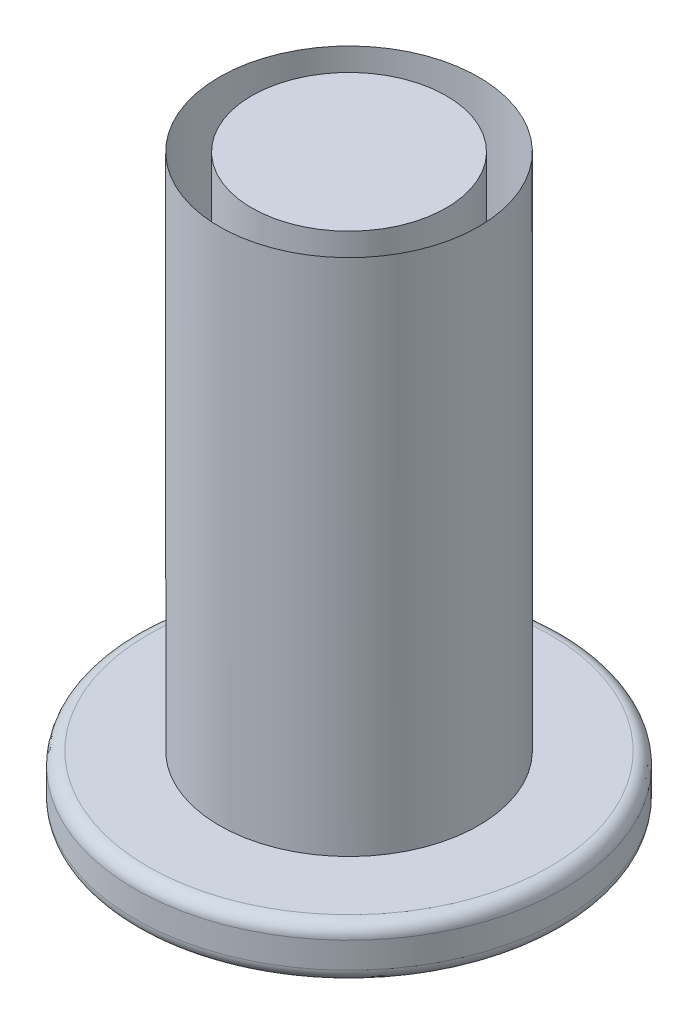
from build123d import *

# Parameters (mm, degrees)
FILLET1_R = 0.1


with BuildPart() as part:
    # Sketch1 → Revolve1 (revolve)
    with BuildSketch(Plane.XY, mode=Mode.PRIVATE) as revolve1_sk:
        Polygon((0, 0), (1.65, 0), (1.65, 0.4), (0.75, 0.4), (0.75, 4.4), (0, 4.4), align=None)
    revolve(revolve1_sk.sketch.rotate(Axis((0, 4.4, 0), (0, -1, 0)), 180), axis=Axis((0, 4.4, 0), (0, -1, 0)))

    # Fillet1
    fillet1_edges = [part.edges().sort_by_distance(p)[0] for p in [
        (1.65, 0.4, 0),
        (1.65, 0, 0),
    ]]
    fillet(fillet1_edges, radius=FILLET1_R)


solid = part.part
